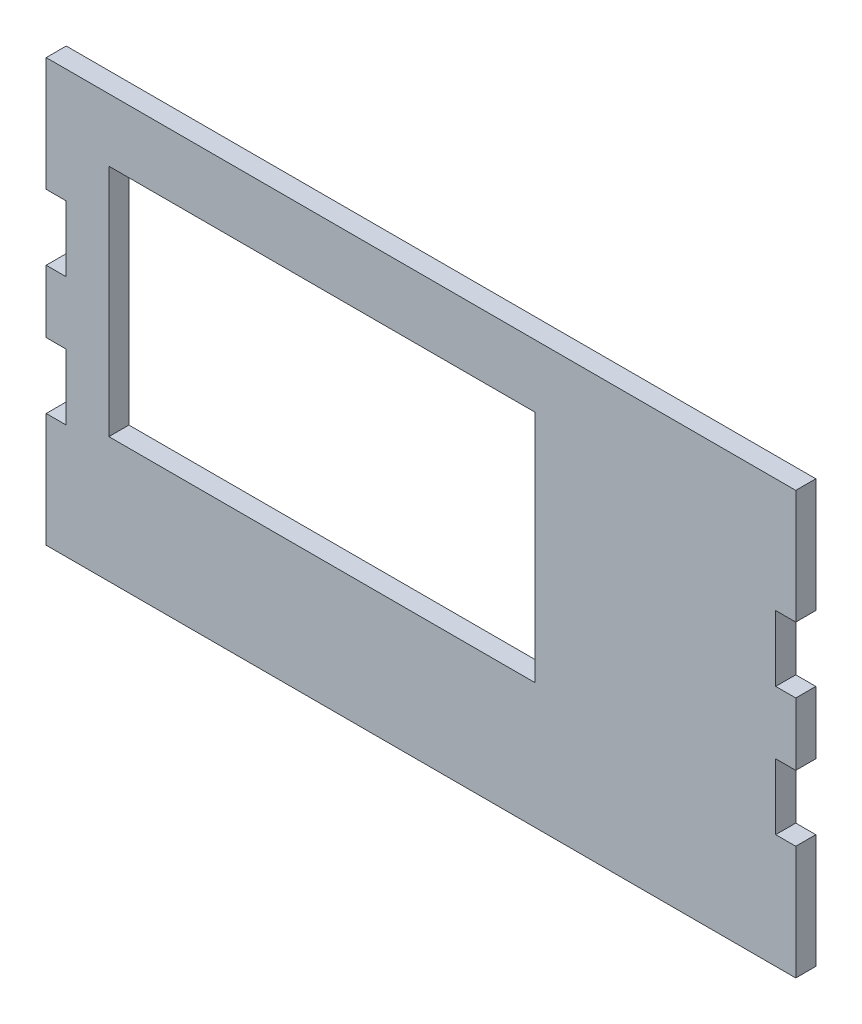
from build123d import *

# Parameters (mm, degrees)
SKETCH1_W           = 340
SKETCH1_H           = 186.8
BOSS_EXTRUDE1_DEPTH = 16


with BuildPart() as part:
    # Sketch1 → Boss-Extrude1 (new body)
    with BuildSketch(Plane.XY):
        Polygon((0, 177.4), (0, 229.8), (-16, 229.8), (-16, 304.8), (-16, 320.8), (0, 320.8), (170, 320.8), (270, 320.8), (581.8, 320.8), (581.8, 304.8), (581.8, 229.8), (565.8, 229.8), (565.8, 177.4), (581.8, 177.4), (581.8, 127.4), (565.8, 127.4), (565.8, 75), (581.8, 75), (581.8, -16), (-16, -16), (-16, 75), (0, 75), (0, 127.4), (-16, 127.4), (-16, 177.4), align=None)
        with Locations((204, 177.4)):
            Rectangle(SKETCH1_W, SKETCH1_H, mode=Mode.SUBTRACT)
    extrude(amount=BOSS_EXTRUDE1_DEPTH)


solid = part.part
